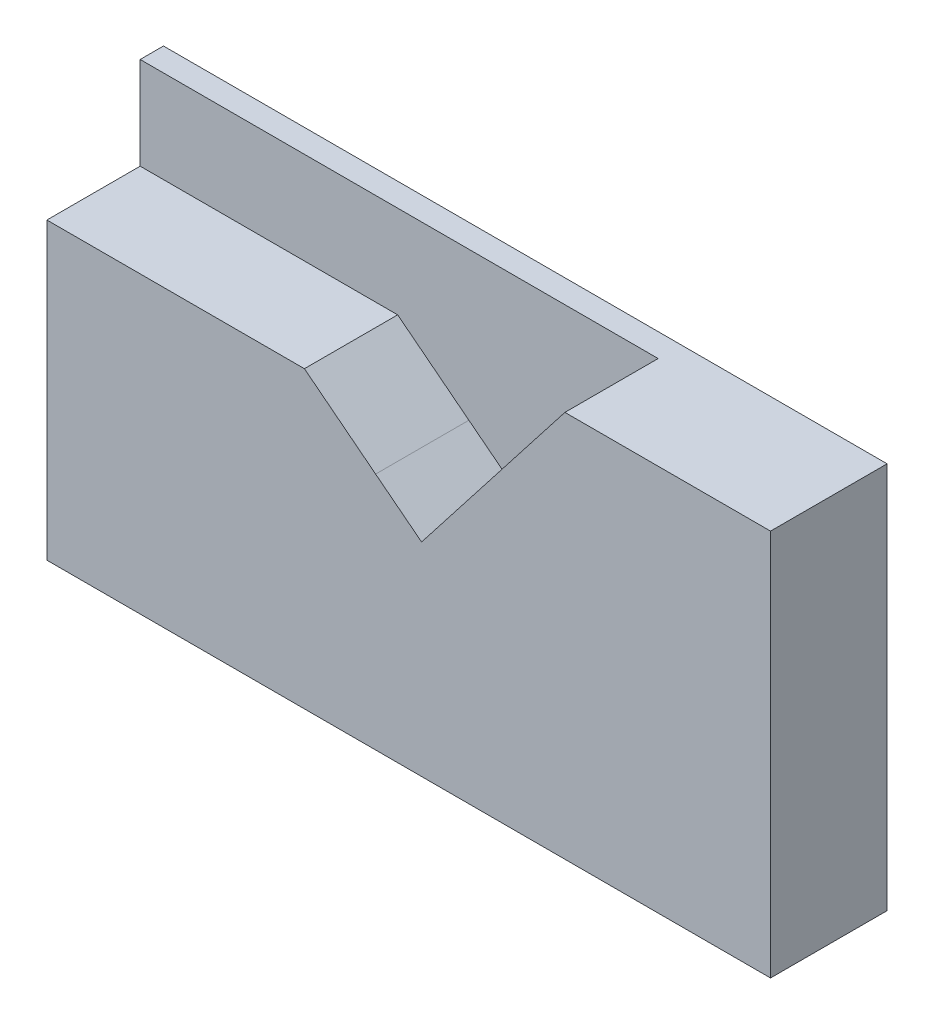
ISO-10303-21;
HEADER;
FILE_DESCRIPTION(('STEP AP214'),'2;1');
FILE_NAME('part.step','',(''),(''),'','','');
FILE_SCHEMA(('AUTOMOTIVE_DESIGN { 1 0 10303 214 1 1 1 1 }'));
ENDSEC;
DATA;
#1=APPLICATION_CONTEXT('core data for automotive mechanical design processes');
#2=APPLICATION_PROTOCOL_DEFINITION('international standard','automotive_design',2000,#1);
#3=PRODUCT_CONTEXT('',#1,'mechanical');
#4=PRODUCT('Part','Part','',(#3));
#5=PRODUCT_RELATED_PRODUCT_CATEGORY('part','',(#4));
#6=PRODUCT_DEFINITION_FORMATION('','',#4);
#7=PRODUCT_DEFINITION_CONTEXT('part definition',#1,'design');
#8=PRODUCT_DEFINITION('design','',#6,#7);
#9=PRODUCT_DEFINITION_SHAPE('','',#8);
#10=(LENGTH_UNIT() NAMED_UNIT(*) SI_UNIT(.MILLI.,.METRE.));
#11=(NAMED_UNIT(*) PLANE_ANGLE_UNIT() SI_UNIT($,.RADIAN.));
#12=(NAMED_UNIT(*) SI_UNIT($,.STERADIAN.) SOLID_ANGLE_UNIT());
#13=UNCERTAINTY_MEASURE_WITH_UNIT(LENGTH_MEASURE(1.E-05),#10,'distance_accuracy_value','');
#14=(GEOMETRIC_REPRESENTATION_CONTEXT(3) GLOBAL_UNCERTAINTY_ASSIGNED_CONTEXT((#13)) GLOBAL_UNIT_ASSIGNED_CONTEXT((#10,
#11,#12)) REPRESENTATION_CONTEXT('',''));
#15=CARTESIAN_POINT('',(0.,0.,0.));
#16=DIRECTION('',(0.,0.,1.));
#17=DIRECTION('',(1.,0.,0.));
#18=AXIS2_PLACEMENT_3D('',#15,#16,#17);
#19=CARTESIAN_POINT('',(6.45095474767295,4.6796596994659,6.35));
#20=DIRECTION('',(0.,-1.,0.));
#21=DIRECTION('',(0.,0.,-1.));
#22=AXIS2_PLACEMENT_3D('',#19,#20,#21);
#23=PLANE('',#22);
#24=DIRECTION('',(-1.,0.,0.));
#25=VECTOR('',#24,1.);
#26=CARTESIAN_POINT('',(34.667647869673,4.67965969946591,1.27));
#27=LINE('',#26,#25);
#28=CARTESIAN_POINT('',(34.667647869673,4.67965969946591,1.27));
#29=VERTEX_POINT('',#28);
#30=CARTESIAN_POINT('',(6.45095474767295,4.6796596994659,1.27));
#31=VERTEX_POINT('',#30);
#32=EDGE_CURVE('E123',#29,#31,#27,.T.);
#33=ORIENTED_EDGE('',*,*,#32,.F.);
#34=DIRECTION('',(0.,0.,1.));
#35=VECTOR('',#34,1.);
#36=CARTESIAN_POINT('',(34.667647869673,4.67965969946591,1.27));
#37=LINE('',#36,#35);
#38=CARTESIAN_POINT('',(34.667647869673,4.67965969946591,6.35));
#39=VERTEX_POINT('',#38);
#40=EDGE_CURVE('E137',#29,#39,#37,.T.);
#41=ORIENTED_EDGE('',*,*,#40,.T.);
#42=DIRECTION('',(-1.,0.,0.));
#43=VECTOR('',#42,1.);
#44=CARTESIAN_POINT('',(6.45095474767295,4.6796596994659,6.35));
#45=LINE('',#44,#43);
#46=CARTESIAN_POINT('',(45.8683794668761,4.6796596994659,6.35));
#47=VERTEX_POINT('',#46);
#48=EDGE_CURVE('E153',#47,#39,#45,.T.);
#49=ORIENTED_EDGE('',*,*,#48,.F.);
#50=DIRECTION('',(0.,0.,-1.));
#51=VECTOR('',#50,1.);
#52=CARTESIAN_POINT('',(45.8683794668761,4.6796596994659,6.35));
#53=LINE('',#52,#51);
#54=CARTESIAN_POINT('',(45.8683794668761,4.6796596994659,0.));
#55=VERTEX_POINT('',#54);
#56=EDGE_CURVE('E160',#47,#55,#53,.T.);
#57=ORIENTED_EDGE('',*,*,#56,.T.);
#58=DIRECTION('',(-1.,0.,0.));
#59=VECTOR('',#58,1.);
#60=CARTESIAN_POINT('',(6.45095474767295,4.6796596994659,0.));
#61=LINE('',#60,#59);
#62=CARTESIAN_POINT('',(6.45095474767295,4.6796596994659,0.));
#63=VERTEX_POINT('',#62);
#64=EDGE_CURVE('E140',#55,#63,#61,.T.);
#65=ORIENTED_EDGE('',*,*,#64,.T.);
#66=DIRECTION('',(0.,0.,-1.));
#67=VECTOR('',#66,1.);
#68=CARTESIAN_POINT('',(6.45095474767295,4.6796596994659,6.35));
#69=LINE('',#68,#67);
#70=EDGE_CURVE('E11',#31,#63,#69,.T.);
#71=ORIENTED_EDGE('',*,*,#70,.F.);
#72=EDGE_LOOP('',(#33,#41,#49,#57,#65,#71));
#73=FACE_BOUND('',#72,.T.);
#74=ADVANCED_FACE('F29',(#73),#23,.F.);
#75=CARTESIAN_POINT('',(6.45095474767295,4.6796596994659,6.35));
#76=DIRECTION('',(1.,0.,0.));
#77=DIRECTION('',(0.,1.,0.));
#78=AXIS2_PLACEMENT_3D('',#75,#76,#77);
#79=PLANE('',#78);
#80=DIRECTION('',(0.,-1.,0.));
#81=VECTOR('',#80,1.);
#82=CARTESIAN_POINT('',(6.45095474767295,4.6796596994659,6.35));
#83=LINE('',#82,#81);
#84=CARTESIAN_POINT('',(6.45095474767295,-0.353770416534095,6.35));
#85=VERTEX_POINT('',#84);
#86=CARTESIAN_POINT('',(6.45095474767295,-16.4023403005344,6.35));
#87=VERTEX_POINT('',#86);
#88=EDGE_CURVE('E155',#85,#87,#83,.T.);
#89=ORIENTED_EDGE('',*,*,#88,.F.);
#90=DIRECTION('',(0.,0.,1.));
#91=VECTOR('',#90,1.);
#92=CARTESIAN_POINT('',(6.45095474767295,-0.353770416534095,1.27));
#93=LINE('',#92,#91);
#94=CARTESIAN_POINT('',(6.45095474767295,-0.353770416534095,1.27));
#95=VERTEX_POINT('',#94);
#96=EDGE_CURVE('E43',#95,#85,#93,.T.);
#97=ORIENTED_EDGE('',*,*,#96,.F.);
#98=DIRECTION('',(0.,-1.,0.));
#99=VECTOR('',#98,1.);
#100=CARTESIAN_POINT('',(6.45095474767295,-0.353770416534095,1.27));
#101=LINE('',#100,#99);
#102=EDGE_CURVE('E125',#31,#95,#101,.T.);
#103=ORIENTED_EDGE('',*,*,#102,.F.);
#104=ORIENTED_EDGE('',*,*,#70,.T.);
#105=DIRECTION('',(0.,-1.,0.));
#106=VECTOR('',#105,1.);
#107=CARTESIAN_POINT('',(6.45095474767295,4.6796596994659,0.));
#108=LINE('',#107,#106);
#109=CARTESIAN_POINT('',(6.45095474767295,-16.4023403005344,0.));
#110=VERTEX_POINT('',#109);
#111=EDGE_CURVE('E147',#63,#110,#108,.T.);
#112=ORIENTED_EDGE('',*,*,#111,.T.);
#113=DIRECTION('',(0.,0.,-1.));
#114=VECTOR('',#113,1.);
#115=CARTESIAN_POINT('',(6.45095474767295,-16.4023403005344,6.35));
#116=LINE('',#115,#114);
#117=EDGE_CURVE('E36',#87,#110,#116,.T.);
#118=ORIENTED_EDGE('',*,*,#117,.F.);
#119=EDGE_LOOP('',(#89,#97,#103,#104,#112,#118));
#120=FACE_BOUND('',#119,.T.);
#121=ADVANCED_FACE('F193',(#120),#79,.F.);
#122=CARTESIAN_POINT('',(45.8683794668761,-16.4023403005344,6.35));
#123=DIRECTION('',(0.,1.,0.));
#124=DIRECTION('',(0.,0.,1.));
#125=AXIS2_PLACEMENT_3D('',#122,#123,#124);
#126=PLANE('',#125);
#127=DIRECTION('',(1.,0.,0.));
#128=VECTOR('',#127,1.);
#129=CARTESIAN_POINT('',(45.8683794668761,-16.4023403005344,0.));
#130=LINE('',#129,#128);
#131=CARTESIAN_POINT('',(45.8683794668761,-16.4023403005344,0.));
#132=VERTEX_POINT('',#131);
#133=EDGE_CURVE('E149',#110,#132,#130,.T.);
#134=ORIENTED_EDGE('',*,*,#133,.T.);
#135=DIRECTION('',(0.,0.,-1.));
#136=VECTOR('',#135,1.);
#137=CARTESIAN_POINT('',(45.8683794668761,-16.4023403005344,6.35));
#138=LINE('',#137,#136);
#139=CARTESIAN_POINT('',(45.8683794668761,-16.4023403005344,6.35));
#140=VERTEX_POINT('',#139);
#141=EDGE_CURVE('E163',#140,#132,#138,.T.);
#142=ORIENTED_EDGE('',*,*,#141,.F.);
#143=DIRECTION('',(1.,0.,0.));
#144=VECTOR('',#143,1.);
#145=CARTESIAN_POINT('',(45.8683794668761,-16.4023403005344,6.35));
#146=LINE('',#145,#144);
#147=EDGE_CURVE('E157',#87,#140,#146,.T.);
#148=ORIENTED_EDGE('',*,*,#147,.F.);
#149=ORIENTED_EDGE('',*,*,#117,.T.);
#150=EDGE_LOOP('',(#134,#142,#148,#149));
#151=FACE_BOUND('',#150,.T.);
#152=ADVANCED_FACE('F170',(#151),#126,.F.);
#153=CARTESIAN_POINT('',(45.8683794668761,4.6796596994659,6.35));
#154=DIRECTION('',(-1.,0.,0.));
#155=DIRECTION('',(0.,0.,1.));
#156=AXIS2_PLACEMENT_3D('',#153,#154,#155);
#157=PLANE('',#156);
#158=DIRECTION('',(0.,1.,0.));
#159=VECTOR('',#158,1.);
#160=CARTESIAN_POINT('',(45.8683794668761,4.6796596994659,0.));
#161=LINE('',#160,#159);
#162=EDGE_CURVE('E151',#132,#55,#161,.T.);
#163=ORIENTED_EDGE('',*,*,#162,.T.);
#164=ORIENTED_EDGE('',*,*,#56,.F.);
#165=DIRECTION('',(0.,1.,0.));
#166=VECTOR('',#165,1.);
#167=CARTESIAN_POINT('',(45.8683794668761,4.6796596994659,6.35));
#168=LINE('',#167,#166);
#169=EDGE_CURVE('E51',#140,#47,#168,.T.);
#170=ORIENTED_EDGE('',*,*,#169,.F.);
#171=ORIENTED_EDGE('',*,*,#141,.T.);
#172=EDGE_LOOP('',(#163,#164,#170,#171));
#173=FACE_BOUND('',#172,.T.);
#174=ADVANCED_FACE('F179',(#173),#157,.F.);
#175=CARTESIAN_POINT('',(45.8683794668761,4.6796596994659,6.35));
#176=DIRECTION('',(0.,0.,-1.));
#177=DIRECTION('',(-1.,0.,0.));
#178=AXIS2_PLACEMENT_3D('',#175,#176,#177);
#179=PLANE('',#178);
#180=ORIENTED_EDGE('',*,*,#48,.T.);
#181=DIRECTION('',(0.614667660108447,0.788786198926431,0.));
#182=VECTOR('',#181,1.);
#183=CARTESIAN_POINT('',(34.667647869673,4.67965969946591,6.35));
#184=LINE('',#183,#182);
#185=CARTESIAN_POINT('',(26.8613685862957,-5.33792502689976,6.35));
#186=VERTEX_POINT('',#185);
#187=EDGE_CURVE('E119',#186,#39,#184,.T.);
#188=ORIENTED_EDGE('',*,*,#187,.F.);
#189=DIRECTION('',(0.788786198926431,-0.614667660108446,0.));
#190=VECTOR('',#189,1.);
#191=CARTESIAN_POINT('',(26.8613685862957,-5.33792502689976,6.35));
#192=LINE('',#191,#190);
#193=CARTESIAN_POINT('',(24.3569724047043,-3.38635520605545,6.35));
#194=VERTEX_POINT('',#193);
#195=EDGE_CURVE('E117',#194,#186,#192,.T.);
#196=ORIENTED_EDGE('',*,*,#195,.F.);
#197=DIRECTION('',(0.787758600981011,-0.615984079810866,0.));
#198=VECTOR('',#197,1.);
#199=CARTESIAN_POINT('',(24.3569724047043,-3.38635520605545,6.35));
#200=LINE('',#199,#198);
#201=CARTESIAN_POINT('',(20.478715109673,-0.353770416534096,6.35));
#202=VERTEX_POINT('',#201);
#203=EDGE_CURVE('E103',#202,#194,#200,.T.);
#204=ORIENTED_EDGE('',*,*,#203,.F.);
#205=DIRECTION('',(1.,0.,0.));
#206=VECTOR('',#205,1.);
#207=CARTESIAN_POINT('',(6.45095474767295,-0.353770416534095,6.35));
#208=LINE('',#207,#206);
#209=EDGE_CURVE('E110',#85,#202,#208,.T.);
#210=ORIENTED_EDGE('',*,*,#209,.F.);
#211=ORIENTED_EDGE('',*,*,#88,.T.);
#212=ORIENTED_EDGE('',*,*,#147,.T.);
#213=ORIENTED_EDGE('',*,*,#169,.T.);
#214=EDGE_LOOP('',(#180,#188,#196,#204,#210,#211,#212,#213));
#215=FACE_BOUND('',#214,.T.);
#216=ADVANCED_FACE('F114',(#215),#179,.F.);
#217=CARTESIAN_POINT('',(45.8683794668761,4.6796596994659,0.));
#218=DIRECTION('',(0.,0.,-1.));
#219=DIRECTION('',(-1.,0.,0.));
#220=AXIS2_PLACEMENT_3D('',#217,#218,#219);
#221=PLANE('',#220);
#222=ORIENTED_EDGE('',*,*,#64,.F.);
#223=ORIENTED_EDGE('',*,*,#162,.F.);
#224=ORIENTED_EDGE('',*,*,#133,.F.);
#225=ORIENTED_EDGE('',*,*,#111,.F.);
#226=EDGE_LOOP('',(#222,#223,#224,#225));
#227=FACE_BOUND('',#226,.T.);
#228=ADVANCED_FACE('F177',(#227),#221,.T.);
#229=CARTESIAN_POINT('',(34.667647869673,4.67965969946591,1.27));
#230=DIRECTION('',(0.788786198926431,-0.614667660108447,0.));
#231=DIRECTION('',(0.614667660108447,0.788786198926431,0.));
#232=AXIS2_PLACEMENT_3D('',#229,#230,#231);
#233=PLANE('',#232);
#234=ORIENTED_EDGE('',*,*,#187,.T.);
#235=ORIENTED_EDGE('',*,*,#40,.F.);
#236=DIRECTION('',(0.614667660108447,0.788786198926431,0.));
#237=VECTOR('',#236,1.);
#238=CARTESIAN_POINT('',(34.667647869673,4.67965969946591,1.27));
#239=LINE('',#238,#237);
#240=CARTESIAN_POINT('',(26.8613685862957,-5.33792502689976,1.27));
#241=VERTEX_POINT('',#240);
#242=EDGE_CURVE('E134',#241,#29,#239,.T.);
#243=ORIENTED_EDGE('',*,*,#242,.F.);
#244=DIRECTION('',(0.,0.,1.));
#245=VECTOR('',#244,1.);
#246=CARTESIAN_POINT('',(26.8613685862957,-5.33792502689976,1.27));
#247=LINE('',#246,#245);
#248=EDGE_CURVE('E141',#241,#186,#247,.T.);
#249=ORIENTED_EDGE('',*,*,#248,.T.);
#250=EDGE_LOOP('',(#234,#235,#243,#249));
#251=FACE_BOUND('',#250,.T.);
#252=ADVANCED_FACE('F185',(#251),#233,.F.);
#253=CARTESIAN_POINT('',(26.8613685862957,-5.33792502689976,1.27));
#254=DIRECTION('',(-0.614667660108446,-0.788786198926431,0.));
#255=DIRECTION('',(0.788786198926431,-0.614667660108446,0.));
#256=AXIS2_PLACEMENT_3D('',#253,#254,#255);
#257=PLANE('',#256);
#258=ORIENTED_EDGE('',*,*,#195,.T.);
#259=ORIENTED_EDGE('',*,*,#248,.F.);
#260=DIRECTION('',(0.788786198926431,-0.614667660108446,0.));
#261=VECTOR('',#260,1.);
#262=CARTESIAN_POINT('',(26.8613685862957,-5.33792502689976,1.27));
#263=LINE('',#262,#261);
#264=CARTESIAN_POINT('',(24.3569724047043,-3.38635520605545,1.27));
#265=VERTEX_POINT('',#264);
#266=EDGE_CURVE('E131',#265,#241,#263,.T.);
#267=ORIENTED_EDGE('',*,*,#266,.F.);
#268=DIRECTION('',(0.,0.,1.));
#269=VECTOR('',#268,1.);
#270=CARTESIAN_POINT('',(24.3569724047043,-3.38635520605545,1.27));
#271=LINE('',#270,#269);
#272=EDGE_CURVE('E108',#265,#194,#271,.T.);
#273=ORIENTED_EDGE('',*,*,#272,.T.);
#274=EDGE_LOOP('',(#258,#259,#267,#273));
#275=FACE_BOUND('',#274,.T.);
#276=ADVANCED_FACE('F189',(#275),#257,.F.);
#277=CARTESIAN_POINT('',(24.3569724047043,-3.38635520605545,1.27));
#278=DIRECTION('',(-0.615984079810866,-0.787758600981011,0.));
#279=DIRECTION('',(0.787758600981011,-0.615984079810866,0.));
#280=AXIS2_PLACEMENT_3D('',#277,#278,#279);
#281=PLANE('',#280);
#282=ORIENTED_EDGE('',*,*,#203,.T.);
#283=ORIENTED_EDGE('',*,*,#272,.F.);
#284=DIRECTION('',(0.787758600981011,-0.615984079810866,0.));
#285=VECTOR('',#284,1.);
#286=CARTESIAN_POINT('',(24.3569724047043,-3.38635520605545,1.27));
#287=LINE('',#286,#285);
#288=CARTESIAN_POINT('',(20.478715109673,-0.353770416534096,1.27));
#289=VERTEX_POINT('',#288);
#290=EDGE_CURVE('E106',#289,#265,#287,.T.);
#291=ORIENTED_EDGE('',*,*,#290,.F.);
#292=DIRECTION('',(0.,0.,1.));
#293=VECTOR('',#292,1.);
#294=CARTESIAN_POINT('',(20.478715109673,-0.353770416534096,1.27));
#295=LINE('',#294,#293);
#296=EDGE_CURVE('E100',#289,#202,#295,.T.);
#297=ORIENTED_EDGE('',*,*,#296,.T.);
#298=EDGE_LOOP('',(#282,#283,#291,#297));
#299=FACE_BOUND('',#298,.T.);
#300=ADVANCED_FACE('F101',(#299),#281,.F.);
#301=CARTESIAN_POINT('',(6.45095474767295,-0.353770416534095,1.27));
#302=DIRECTION('',(0.,-1.,0.));
#303=DIRECTION('',(1.,0.,0.));
#304=AXIS2_PLACEMENT_3D('',#301,#302,#303);
#305=PLANE('',#304);
#306=ORIENTED_EDGE('',*,*,#209,.T.);
#307=ORIENTED_EDGE('',*,*,#296,.F.);
#308=DIRECTION('',(1.,0.,0.));
#309=VECTOR('',#308,1.);
#310=CARTESIAN_POINT('',(6.45095474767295,-0.353770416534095,1.27));
#311=LINE('',#310,#309);
#312=EDGE_CURVE('E128',#95,#289,#311,.T.);
#313=ORIENTED_EDGE('',*,*,#312,.F.);
#314=ORIENTED_EDGE('',*,*,#96,.T.);
#315=EDGE_LOOP('',(#306,#307,#313,#314));
#316=FACE_BOUND('',#315,.T.);
#317=ADVANCED_FACE('F111',(#316),#305,.F.);
#318=CARTESIAN_POINT('',(6.45095474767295,4.6796596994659,1.27));
#319=DIRECTION('',(0.,0.,-1.));
#320=DIRECTION('',(-1.,0.,0.));
#321=AXIS2_PLACEMENT_3D('',#318,#319,#320);
#322=PLANE('',#321);
#323=ORIENTED_EDGE('',*,*,#32,.T.);
#324=ORIENTED_EDGE('',*,*,#102,.T.);
#325=ORIENTED_EDGE('',*,*,#312,.T.);
#326=ORIENTED_EDGE('',*,*,#290,.T.);
#327=ORIENTED_EDGE('',*,*,#266,.T.);
#328=ORIENTED_EDGE('',*,*,#242,.T.);
#329=EDGE_LOOP('',(#323,#324,#325,#326,#327,#328));
#330=FACE_BOUND('',#329,.T.);
#331=ADVANCED_FACE('F191',(#330),#322,.F.);
#332=CLOSED_SHELL('',(#74,#121,#152,#174,#216,#228,#252,#276,#300,#317,#331));
#333=MANIFOLD_SOLID_BREP('B2',#332);
#334=ADVANCED_BREP_SHAPE_REPRESENTATION('',(#18,#333),#14);
#335=SHAPE_DEFINITION_REPRESENTATION(#9,#334);
ENDSEC;
END-ISO-10303-21;
